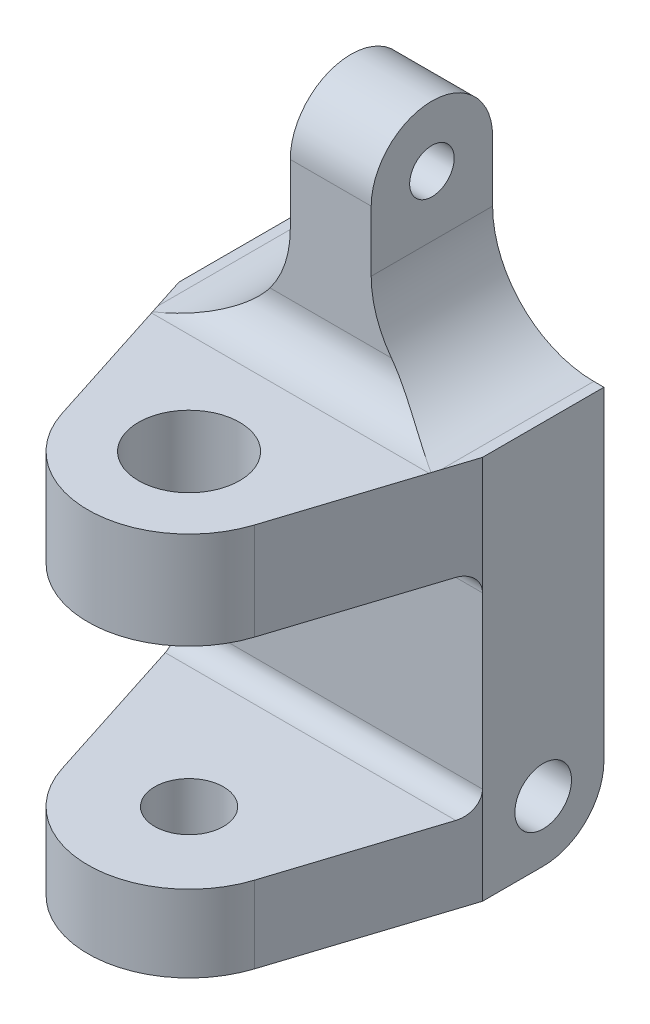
ISO-10303-21;
HEADER;
FILE_DESCRIPTION(('STEP AP214'),'2;1');
FILE_NAME('part.step','',(''),(''),'','','');
FILE_SCHEMA(('AUTOMOTIVE_DESIGN { 1 0 10303 214 1 1 1 1 }'));
ENDSEC;
DATA;
#1=APPLICATION_CONTEXT('core data for automotive mechanical design processes');
#2=APPLICATION_PROTOCOL_DEFINITION('international standard','automotive_design',2000,#1);
#3=PRODUCT_CONTEXT('',#1,'mechanical');
#4=PRODUCT('Part','Part','',(#3));
#5=PRODUCT_RELATED_PRODUCT_CATEGORY('part','',(#4));
#6=PRODUCT_DEFINITION_FORMATION('','',#4);
#7=PRODUCT_DEFINITION_CONTEXT('part definition',#1,'design');
#8=PRODUCT_DEFINITION('design','',#6,#7);
#9=PRODUCT_DEFINITION_SHAPE('','',#8);
#10=(LENGTH_UNIT() NAMED_UNIT(*) SI_UNIT(.MILLI.,.METRE.));
#11=(NAMED_UNIT(*) PLANE_ANGLE_UNIT() SI_UNIT($,.RADIAN.));
#12=(NAMED_UNIT(*) SI_UNIT($,.STERADIAN.) SOLID_ANGLE_UNIT());
#13=UNCERTAINTY_MEASURE_WITH_UNIT(LENGTH_MEASURE(1.E-05),#10,'distance_accuracy_value','');
#14=(GEOMETRIC_REPRESENTATION_CONTEXT(3) GLOBAL_UNCERTAINTY_ASSIGNED_CONTEXT((#13)) GLOBAL_UNIT_ASSIGNED_CONTEXT((#10,
#11,#12)) REPRESENTATION_CONTEXT('',''));
#15=CARTESIAN_POINT('',(0.,0.,0.));
#16=DIRECTION('',(0.,0.,1.));
#17=DIRECTION('',(1.,0.,0.));
#18=AXIS2_PLACEMENT_3D('',#15,#16,#17);
#19=CARTESIAN_POINT('',(0.,-19.05,12.7));
#20=DIRECTION('',(0.,1.,0.));
#21=DIRECTION('',(0.,0.,1.));
#22=AXIS2_PLACEMENT_3D('',#19,#20,#21);
#23=CYLINDRICAL_SURFACE('',#22,2.159);
#24=CARTESIAN_POINT('',(0.,-14.224,12.7));
#25=DIRECTION('',(0.,-1.,0.));
#26=DIRECTION('',(0.,0.,-1.));
#27=AXIS2_PLACEMENT_3D('',#24,#25,#26);
#28=CIRCLE('',#27,2.159);
#29=CARTESIAN_POINT('',(0.,-14.224,10.541));
#30=VERTEX_POINT('',#29);
#31=EDGE_CURVE('E335',#30,#30,#28,.T.);
#32=ORIENTED_EDGE('',*,*,#31,.F.);
#33=EDGE_LOOP('',(#32));
#34=FACE_BOUND('',#33,.T.);
#35=CARTESIAN_POINT('',(0.,-17.78,12.7));
#36=DIRECTION('',(0.,-1.,0.));
#37=DIRECTION('',(0.,0.,-1.));
#38=AXIS2_PLACEMENT_3D('',#35,#36,#37);
#39=CIRCLE('',#38,2.159);
#40=CARTESIAN_POINT('',(0.,-17.78,10.541));
#41=VERTEX_POINT('',#40);
#42=EDGE_CURVE('E36',#41,#41,#39,.F.);
#43=ORIENTED_EDGE('',*,*,#42,.F.);
#44=EDGE_LOOP('',(#43));
#45=FACE_BOUND('',#44,.T.);
#46=ADVANCED_FACE('F32',(#34,#45),#23,.F.);
#47=CARTESIAN_POINT('',(0.,-1.016,12.7));
#48=DIRECTION('',(0.,1.,0.));
#49=DIRECTION('',(0.,0.,1.));
#50=AXIS2_PLACEMENT_3D('',#47,#48,#49);
#51=CIRCLE('',#50,2.159);
#52=CARTESIAN_POINT('',(0.,-1.016,14.859));
#53=VERTEX_POINT('',#52);
#54=EDGE_CURVE('E336',#53,#53,#51,.T.);
#55=ORIENTED_EDGE('',*,*,#54,.F.);
#56=EDGE_LOOP('',(#55));
#57=FACE_BOUND('',#56,.T.);
#58=CARTESIAN_POINT('',(0.,0.,12.7));
#59=DIRECTION('',(0.,1.,0.));
#60=DIRECTION('',(0.,0.,1.));
#61=AXIS2_PLACEMENT_3D('',#58,#59,#60);
#62=CIRCLE('',#61,2.159);
#63=CARTESIAN_POINT('',(0.,0.,14.859));
#64=VERTEX_POINT('',#63);
#65=EDGE_CURVE('E277',#64,#64,#62,.F.);
#66=ORIENTED_EDGE('',*,*,#65,.F.);
#67=EDGE_LOOP('',(#66));
#68=FACE_BOUND('',#67,.T.);
#69=ADVANCED_FACE('F526',(#57,#68),#23,.F.);
#70=CARTESIAN_POINT('',(9.525,-19.05,3.81000000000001));
#71=DIRECTION('',(0.952091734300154,0.,0.305812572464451));
#72=DIRECTION('',(0.305812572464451,0.,-0.952091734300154));
#73=AXIS2_PLACEMENT_3D('',#70,#71,#72);
#74=PLANE('',#73);
#75=DIRECTION('',(0.305812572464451,0.,-0.952091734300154));
#76=VECTOR('',#75,1.);
#77=CARTESIAN_POINT('',(9.525,5.08,3.81));
#78=LINE('',#77,#76);
#79=CARTESIAN_POINT('',(8.89,5.08,5.78695682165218));
#80=VERTEX_POINT('',#79);
#81=CARTESIAN_POINT('',(9.525,5.08,3.81000000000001));
#82=VERTEX_POINT('',#81);
#83=EDGE_CURVE('E333',#80,#82,#78,.T.);
#84=ORIENTED_EDGE('',*,*,#83,.F.);
#85=CARTESIAN_POINT('',(8.89,11.43,5.78695682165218));
#86=DIRECTION('',(0.952091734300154,0.,0.305812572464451));
#87=DIRECTION('',(-0.305812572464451,0.,0.952091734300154));
#88=AXIS2_PLACEMENT_3D('',#85,#86,#87);
#89=ELLIPSE('',#88,20.7643523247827,6.35);
#90=CARTESIAN_POINT('',(8.73968306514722,5.08177939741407,6.25494121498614));
#91=VERTEX_POINT('',#90);
#92=EDGE_CURVE('E325',#91,#80,#89,.T.);
#93=ORIENTED_EDGE('',*,*,#92,.F.);
#94=CARTESIAN_POINT('',(8.70915011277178,7.62,6.35000000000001));
#95=DIRECTION('',(0.952091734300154,0.,0.305812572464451));
#96=DIRECTION('',(0.305812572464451,0.,-0.952091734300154));
#97=AXIS2_PLACEMENT_3D('',#94,#95,#96);
#98=ELLIPSE('',#97,2.66781015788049,2.54);
#99=CARTESIAN_POINT('',(8.70915011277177,5.08,6.35000000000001));
#100=VERTEX_POINT('',#99);
#101=EDGE_CURVE('E373',#100,#91,#98,.T.);
#102=ORIENTED_EDGE('',*,*,#101,.F.);
#103=DIRECTION('',(0.305812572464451,0.,-0.952091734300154));
#104=VECTOR('',#103,1.);
#105=CARTESIAN_POINT('',(9.525,5.08,3.81000000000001));
#106=LINE('',#105,#104);
#107=CARTESIAN_POINT('',(6.04578251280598,5.08,14.6419098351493));
#108=VERTEX_POINT('',#107);
#109=EDGE_CURVE('E371',#108,#100,#106,.T.);
#110=ORIENTED_EDGE('',*,*,#109,.F.);
#111=DIRECTION('',(0.,1.,0.));
#112=VECTOR('',#111,1.);
#113=CARTESIAN_POINT('',(6.04578251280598,-19.05,14.6419098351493));
#114=LINE('',#113,#112);
#115=CARTESIAN_POINT('',(6.04578251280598,-1.016,14.6419098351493));
#116=VERTEX_POINT('',#115);
#117=EDGE_CURVE('E409',#116,#108,#114,.T.);
#118=ORIENTED_EDGE('',*,*,#117,.F.);
#119=DIRECTION('',(-0.305812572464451,0.,0.952091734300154));
#120=VECTOR('',#119,1.);
#121=CARTESIAN_POINT('',(9.525,-1.016,3.81000000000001));
#122=LINE('',#121,#120);
#123=CARTESIAN_POINT('',(9.11707505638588,-1.016,5.08000000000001));
#124=VERTEX_POINT('',#123);
#125=EDGE_CURVE('E386',#124,#116,#122,.T.);
#126=ORIENTED_EDGE('',*,*,#125,.F.);
#127=CARTESIAN_POINT('',(9.11707505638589,-2.286,5.08000000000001));
#128=DIRECTION('',(0.952091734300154,0.,0.305812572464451));
#129=DIRECTION('',(0.305812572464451,0.,-0.952091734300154));
#130=AXIS2_PLACEMENT_3D('',#127,#128,#129);
#131=ELLIPSE('',#130,1.33390507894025,1.27);
#132=CARTESIAN_POINT('',(9.525,-2.286,3.81000000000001));
#133=VERTEX_POINT('',#132);
#134=EDGE_CURVE('E382',#133,#124,#131,.T.);
#135=ORIENTED_EDGE('',*,*,#134,.F.);
#136=DIRECTION('',(0.,-1.,0.));
#137=VECTOR('',#136,1.);
#138=CARTESIAN_POINT('',(9.525,15.24,3.81000000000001));
#139=LINE('',#138,#137);
#140=EDGE_CURVE('E413',#82,#133,#139,.T.);
#141=ORIENTED_EDGE('',*,*,#140,.F.);
#142=EDGE_LOOP('',(#84,#93,#102,#110,#118,#126,#135,#141));
#143=FACE_BOUND('',#142,.T.);
#144=ADVANCED_FACE('F499',(#143),#74,.T.);
#145=CARTESIAN_POINT('',(0.,-19.05,12.7));
#146=DIRECTION('',(0.,1.,0.));
#147=DIRECTION('',(0.,0.,1.));
#148=AXIS2_PLACEMENT_3D('',#145,#146,#147);
#149=CYLINDRICAL_SURFACE('',#148,6.35);
#150=CARTESIAN_POINT('',(0.,-1.016,12.7));
#151=DIRECTION('',(0.,1.,0.));
#152=DIRECTION('',(0.,0.,1.));
#153=AXIS2_PLACEMENT_3D('',#150,#151,#152);
#154=CIRCLE('',#153,6.35);
#155=CARTESIAN_POINT('',(-6.04578251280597,-1.016,14.6419098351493));
#156=VERTEX_POINT('',#155);
#157=EDGE_CURVE('E384',#116,#156,#154,.F.);
#158=ORIENTED_EDGE('',*,*,#157,.F.);
#159=ORIENTED_EDGE('',*,*,#117,.T.);
#160=CARTESIAN_POINT('',(0.,5.08,12.7));
#161=DIRECTION('',(0.,-1.,0.));
#162=DIRECTION('',(0.,0.,-1.));
#163=AXIS2_PLACEMENT_3D('',#160,#161,#162);
#164=CIRCLE('',#163,6.35);
#165=CARTESIAN_POINT('',(-6.04578251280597,5.08,14.6419098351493));
#166=VERTEX_POINT('',#165);
#167=EDGE_CURVE('E357',#166,#108,#164,.F.);
#168=ORIENTED_EDGE('',*,*,#167,.F.);
#169=DIRECTION('',(0.,1.,0.));
#170=VECTOR('',#169,1.);
#171=CARTESIAN_POINT('',(-6.04578251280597,-19.05,14.6419098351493));
#172=LINE('',#171,#170);
#173=EDGE_CURVE('E404',#156,#166,#172,.T.);
#174=ORIENTED_EDGE('',*,*,#173,.F.);
#175=EDGE_LOOP('',(#158,#159,#168,#174));
#176=FACE_BOUND('',#175,.T.);
#177=ADVANCED_FACE('F503',(#176),#149,.T.);
#178=CARTESIAN_POINT('',(-9.525,-19.05,3.81000000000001));
#179=DIRECTION('',(-0.952091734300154,0.,0.305812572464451));
#180=DIRECTION('',(0.305812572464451,0.,0.952091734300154));
#181=AXIS2_PLACEMENT_3D('',#178,#179,#180);
#182=PLANE('',#181);
#183=CARTESIAN_POINT('',(-8.89,11.43,5.78695682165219));
#184=DIRECTION('',(-0.952091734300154,0.,0.305812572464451));
#185=DIRECTION('',(0.305812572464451,0.,0.952091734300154));
#186=AXIS2_PLACEMENT_3D('',#183,#184,#185);
#187=ELLIPSE('',#186,20.7643523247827,6.35);
#188=CARTESIAN_POINT('',(-8.89,5.08,5.78695682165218));
#189=VERTEX_POINT('',#188);
#190=CARTESIAN_POINT('',(-8.73968306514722,5.08177939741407,6.25494121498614));
#191=VERTEX_POINT('',#190);
#192=EDGE_CURVE('E57',#189,#191,#187,.T.);
#193=ORIENTED_EDGE('',*,*,#192,.F.);
#194=DIRECTION('',(0.305812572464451,0.,0.952091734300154));
#195=VECTOR('',#194,1.);
#196=CARTESIAN_POINT('',(-9.525,5.08,3.81));
#197=LINE('',#196,#195);
#198=CARTESIAN_POINT('',(-9.525,5.08,3.81000000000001));
#199=VERTEX_POINT('',#198);
#200=EDGE_CURVE('E331',#199,#189,#197,.T.);
#201=ORIENTED_EDGE('',*,*,#200,.F.);
#202=DIRECTION('',(0.,-1.,0.));
#203=VECTOR('',#202,1.);
#204=CARTESIAN_POINT('',(-9.525,15.24,3.81000000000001));
#205=LINE('',#204,#203);
#206=CARTESIAN_POINT('',(-9.525,-2.286,3.81));
#207=VERTEX_POINT('',#206);
#208=EDGE_CURVE('E422',#199,#207,#205,.T.);
#209=ORIENTED_EDGE('',*,*,#208,.T.);
#210=CARTESIAN_POINT('',(-9.11707505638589,-2.286,5.08000000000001));
#211=DIRECTION('',(-0.952091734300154,0.,0.305812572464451));
#212=DIRECTION('',(0.305812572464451,0.,0.952091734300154));
#213=AXIS2_PLACEMENT_3D('',#210,#211,#212);
#214=ELLIPSE('',#213,1.33390507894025,1.27);
#215=CARTESIAN_POINT('',(-9.11707505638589,-1.016,5.08000000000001));
#216=VERTEX_POINT('',#215);
#217=EDGE_CURVE('E445',#216,#207,#214,.T.);
#218=ORIENTED_EDGE('',*,*,#217,.F.);
#219=DIRECTION('',(-0.305812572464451,0.,-0.952091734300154));
#220=VECTOR('',#219,1.);
#221=CARTESIAN_POINT('',(-9.525,-1.016,3.81000000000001));
#222=LINE('',#221,#220);
#223=EDGE_CURVE('E448',#156,#216,#222,.T.);
#224=ORIENTED_EDGE('',*,*,#223,.F.);
#225=ORIENTED_EDGE('',*,*,#173,.T.);
#226=DIRECTION('',(0.305812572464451,0.,0.952091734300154));
#227=VECTOR('',#226,1.);
#228=CARTESIAN_POINT('',(-9.525,5.08,3.81000000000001));
#229=LINE('',#228,#227);
#230=CARTESIAN_POINT('',(-8.70915011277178,5.08,6.35000000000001));
#231=VERTEX_POINT('',#230);
#232=EDGE_CURVE('E437',#231,#166,#229,.T.);
#233=ORIENTED_EDGE('',*,*,#232,.F.);
#234=CARTESIAN_POINT('',(-8.70915011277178,7.62,6.35000000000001));
#235=DIRECTION('',(-0.952091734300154,0.,0.305812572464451));
#236=DIRECTION('',(0.305812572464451,0.,0.952091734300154));
#237=AXIS2_PLACEMENT_3D('',#234,#235,#236);
#238=ELLIPSE('',#237,2.66781015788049,2.54);
#239=EDGE_CURVE('E439',#191,#231,#238,.T.);
#240=ORIENTED_EDGE('',*,*,#239,.F.);
#241=EDGE_LOOP('',(#193,#201,#209,#218,#224,#225,#233,#240));
#242=FACE_BOUND('',#241,.T.);
#243=ADVANCED_FACE('F507',(#242),#182,.T.);
#244=CARTESIAN_POINT('',(9.525,15.24,0.));
#245=DIRECTION('',(-1.,0.,0.));
#246=DIRECTION('',(0.,0.,1.));
#247=AXIS2_PLACEMENT_3D('',#244,#245,#246);
#248=CYLINDRICAL_SURFACE('',#247,3.81);
#249=CARTESIAN_POINT('',(-2.54,15.24,0.));
#250=DIRECTION('',(1.,0.,0.));
#251=DIRECTION('',(0.,1.,0.));
#252=AXIS2_PLACEMENT_3D('',#249,#250,#251);
#253=CIRCLE('',#252,3.81);
#254=CARTESIAN_POINT('',(-2.54,15.24,-3.81));
#255=VERTEX_POINT('',#254);
#256=CARTESIAN_POINT('',(-2.54,15.24,3.81000000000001));
#257=VERTEX_POINT('',#256);
#258=EDGE_CURVE('E320',#255,#257,#253,.T.);
#259=ORIENTED_EDGE('',*,*,#258,.T.);
#260=DIRECTION('',(-1.,0.,0.));
#261=VECTOR('',#260,1.);
#262=CARTESIAN_POINT('',(9.525,15.24,3.81000000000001));
#263=LINE('',#262,#261);
#264=CARTESIAN_POINT('',(2.54000000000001,15.24,3.81000000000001));
#265=VERTEX_POINT('',#264);
#266=EDGE_CURVE('E434',#265,#257,#263,.T.);
#267=ORIENTED_EDGE('',*,*,#266,.F.);
#268=CARTESIAN_POINT('',(2.54000000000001,15.24,0.));
#269=DIRECTION('',(-1.,0.,0.));
#270=DIRECTION('',(0.,-1.,0.));
#271=AXIS2_PLACEMENT_3D('',#268,#269,#270);
#272=CIRCLE('',#271,3.81);
#273=CARTESIAN_POINT('',(2.54000000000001,15.24,-3.81));
#274=VERTEX_POINT('',#273);
#275=EDGE_CURVE('E314',#265,#274,#272,.T.);
#276=ORIENTED_EDGE('',*,*,#275,.T.);
#277=DIRECTION('',(-1.,0.,0.));
#278=VECTOR('',#277,1.);
#279=CARTESIAN_POINT('',(9.525,15.24,-3.80999999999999));
#280=LINE('',#279,#278);
#281=EDGE_CURVE('E421',#274,#255,#280,.T.);
#282=ORIENTED_EDGE('',*,*,#281,.T.);
#283=EDGE_LOOP('',(#259,#267,#276,#282));
#284=FACE_BOUND('',#283,.T.);
#285=ADVANCED_FACE('F34',(#284),#248,.T.);
#286=CARTESIAN_POINT('',(9.525,-15.24,0.));
#287=DIRECTION('',(-1.,0.,0.));
#288=DIRECTION('',(0.,0.,1.));
#289=AXIS2_PLACEMENT_3D('',#286,#287,#288);
#290=CYLINDRICAL_SURFACE('',#289,3.81);
#291=CARTESIAN_POINT('',(9.525,-15.24,0.));
#292=DIRECTION('',(1.,0.,0.));
#293=DIRECTION('',(0.,0.,-1.));
#294=AXIS2_PLACEMENT_3D('',#291,#292,#293);
#295=CIRCLE('',#294,3.81);
#296=CARTESIAN_POINT('',(9.525,-19.05,0.));
#297=VERTEX_POINT('',#296);
#298=CARTESIAN_POINT('',(9.525,-15.24,-3.81));
#299=VERTEX_POINT('',#298);
#300=EDGE_CURVE('E415',#297,#299,#295,.T.);
#301=ORIENTED_EDGE('',*,*,#300,.F.);
#302=DIRECTION('',(-1.,0.,0.));
#303=VECTOR('',#302,1.);
#304=CARTESIAN_POINT('',(-9.525,-19.05,0.));
#305=LINE('',#304,#303);
#306=CARTESIAN_POINT('',(-9.525,-19.05,0.));
#307=VERTEX_POINT('',#306);
#308=EDGE_CURVE('E391',#297,#307,#305,.T.);
#309=ORIENTED_EDGE('',*,*,#308,.T.);
#310=CARTESIAN_POINT('',(-9.525,-15.24,0.));
#311=DIRECTION('',(1.,0.,0.));
#312=DIRECTION('',(0.,0.,-1.));
#313=AXIS2_PLACEMENT_3D('',#310,#311,#312);
#314=CIRCLE('',#313,3.81);
#315=CARTESIAN_POINT('',(-9.525,-15.24,-3.81));
#316=VERTEX_POINT('',#315);
#317=EDGE_CURVE('E424',#307,#316,#314,.T.);
#318=ORIENTED_EDGE('',*,*,#317,.T.);
#319=DIRECTION('',(-1.,0.,0.));
#320=VECTOR('',#319,1.);
#321=CARTESIAN_POINT('',(9.525,-15.24,-3.81));
#322=LINE('',#321,#320);
#323=EDGE_CURVE('E431',#299,#316,#322,.T.);
#324=ORIENTED_EDGE('',*,*,#323,.F.);
#325=EDGE_LOOP('',(#301,#309,#318,#324));
#326=FACE_BOUND('',#325,.T.);
#327=ADVANCED_FACE('F517',(#326),#290,.T.);
#328=CARTESIAN_POINT('',(9.525,15.24,-3.80999999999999));
#329=DIRECTION('',(0.,0.,1.));
#330=DIRECTION('',(0.,-1.,0.));
#331=AXIS2_PLACEMENT_3D('',#328,#329,#330);
#332=PLANE('',#331);
#333=CARTESIAN_POINT('',(-8.89,11.43,-3.81));
#334=DIRECTION('',(0.,0.,1.));
#335=DIRECTION('',(-1.,0.,0.));
#336=AXIS2_PLACEMENT_3D('',#333,#334,#335);
#337=CIRCLE('',#336,6.35);
#338=CARTESIAN_POINT('',(-8.89,5.08,-3.81));
#339=VERTEX_POINT('',#338);
#340=CARTESIAN_POINT('',(-2.54,11.43,-3.81));
#341=VERTEX_POINT('',#340);
#342=EDGE_CURVE('E284',#339,#341,#337,.T.);
#343=ORIENTED_EDGE('',*,*,#342,.T.);
#344=DIRECTION('',(0.,1.,0.));
#345=VECTOR('',#344,1.);
#346=CARTESIAN_POINT('',(-2.54,19.05,-3.81));
#347=LINE('',#346,#345);
#348=EDGE_CURVE('E288',#341,#255,#347,.T.);
#349=ORIENTED_EDGE('',*,*,#348,.T.);
#350=ORIENTED_EDGE('',*,*,#281,.F.);
#351=DIRECTION('',(0.,-1.,0.));
#352=VECTOR('',#351,1.);
#353=CARTESIAN_POINT('',(2.54000000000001,19.05,-3.81));
#354=LINE('',#353,#352);
#355=CARTESIAN_POINT('',(2.54000000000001,11.43,-3.81));
#356=VERTEX_POINT('',#355);
#357=EDGE_CURVE('E297',#274,#356,#354,.T.);
#358=ORIENTED_EDGE('',*,*,#357,.T.);
#359=CARTESIAN_POINT('',(8.89,11.43,-3.81));
#360=DIRECTION('',(0.,0.,1.));
#361=DIRECTION('',(1.,0.,0.));
#362=AXIS2_PLACEMENT_3D('',#359,#360,#361);
#363=CIRCLE('',#362,6.35);
#364=CARTESIAN_POINT('',(8.89,5.08,-3.81));
#365=VERTEX_POINT('',#364);
#366=EDGE_CURVE('E300',#356,#365,#363,.T.);
#367=ORIENTED_EDGE('',*,*,#366,.T.);
#368=DIRECTION('',(1.,0.,0.));
#369=VECTOR('',#368,1.);
#370=CARTESIAN_POINT('',(8.89,5.08,-3.81));
#371=LINE('',#370,#369);
#372=CARTESIAN_POINT('',(9.525,5.08,-3.81));
#373=VERTEX_POINT('',#372);
#374=EDGE_CURVE('E303',#365,#373,#371,.T.);
#375=ORIENTED_EDGE('',*,*,#374,.T.);
#376=DIRECTION('',(0.,1.,0.));
#377=VECTOR('',#376,1.);
#378=CARTESIAN_POINT('',(9.525,15.24,-3.80999999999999));
#379=LINE('',#378,#377);
#380=EDGE_CURVE('E418',#299,#373,#379,.T.);
#381=ORIENTED_EDGE('',*,*,#380,.F.);
#382=ORIENTED_EDGE('',*,*,#323,.T.);
#383=DIRECTION('',(0.,1.,0.));
#384=VECTOR('',#383,1.);
#385=CARTESIAN_POINT('',(-9.525,15.24,-3.80999999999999));
#386=LINE('',#385,#384);
#387=CARTESIAN_POINT('',(-9.525,5.08,-3.81));
#388=VERTEX_POINT('',#387);
#389=EDGE_CURVE('E426',#316,#388,#386,.T.);
#390=ORIENTED_EDGE('',*,*,#389,.T.);
#391=DIRECTION('',(1.,0.,0.));
#392=VECTOR('',#391,1.);
#393=CARTESIAN_POINT('',(-8.89,5.08,-3.81));
#394=LINE('',#393,#392);
#395=EDGE_CURVE('E281',#388,#339,#394,.T.);
#396=ORIENTED_EDGE('',*,*,#395,.T.);
#397=EDGE_LOOP('',(#343,#349,#350,#358,#367,#375,#381,#382,#390,#396));
#398=FACE_BOUND('',#397,.T.);
#399=ADVANCED_FACE('F511',(#398),#332,.F.);
#400=CARTESIAN_POINT('',(9.525,15.24,0.));
#401=DIRECTION('',(1.,0.,0.));
#402=DIRECTION('',(0.,0.,-1.));
#403=AXIS2_PLACEMENT_3D('',#400,#401,#402);
#404=PLANE('',#403);
#405=DIRECTION('',(0.,0.,-1.));
#406=VECTOR('',#405,1.);
#407=CARTESIAN_POINT('',(9.525,5.08,0.));
#408=LINE('',#407,#406);
#409=EDGE_CURVE('E11',#82,#373,#408,.T.);
#410=ORIENTED_EDGE('',*,*,#409,.F.);
#411=ORIENTED_EDGE('',*,*,#140,.T.);
#412=DIRECTION('',(0.,1.,0.));
#413=VECTOR('',#412,1.);
#414=CARTESIAN_POINT('',(9.525,-12.954,3.81000000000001));
#415=LINE('',#414,#413);
#416=CARTESIAN_POINT('',(9.525,-12.954,3.81000000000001));
#417=VERTEX_POINT('',#416);
#418=EDGE_CURVE('E346',#417,#133,#415,.T.);
#419=ORIENTED_EDGE('',*,*,#418,.F.);
#420=CARTESIAN_POINT('',(9.525,-19.05,3.81000000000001));
#421=VERTEX_POINT('',#420);
#422=EDGE_CURVE('E416',#417,#421,#139,.T.);
#423=ORIENTED_EDGE('',*,*,#422,.T.);
#424=DIRECTION('',(0.,0.,-1.));
#425=VECTOR('',#424,1.);
#426=CARTESIAN_POINT('',(9.525,-19.05,0.));
#427=LINE('',#426,#425);
#428=EDGE_CURVE('E388',#421,#297,#427,.T.);
#429=ORIENTED_EDGE('',*,*,#428,.T.);
#430=ORIENTED_EDGE('',*,*,#300,.T.);
#431=ORIENTED_EDGE('',*,*,#380,.T.);
#432=EDGE_LOOP('',(#410,#411,#419,#423,#429,#430,#431));
#433=FACE_BOUND('',#432,.T.);
#434=CARTESIAN_POINT('',(9.525,-15.24,0.));
#435=DIRECTION('',(-1.,0.,0.));
#436=DIRECTION('',(0.,0.,1.));
#437=AXIS2_PLACEMENT_3D('',#434,#435,#436);
#438=CIRCLE('',#437,1.778);
#439=CARTESIAN_POINT('',(9.525,-15.24,1.778));
#440=VERTEX_POINT('',#439);
#441=EDGE_CURVE('E340',#440,#440,#438,.T.);
#442=ORIENTED_EDGE('',*,*,#441,.T.);
#443=EDGE_LOOP('',(#442));
#444=FACE_BOUND('',#443,.T.);
#445=ADVANCED_FACE('F508',(#433,#444),#404,.T.);
#446=CARTESIAN_POINT('',(-9.525,15.24,0.));
#447=DIRECTION('',(1.,0.,0.));
#448=DIRECTION('',(0.,0.,-1.));
#449=AXIS2_PLACEMENT_3D('',#446,#447,#448);
#450=PLANE('',#449);
#451=CARTESIAN_POINT('',(-9.525,-15.24,0.));
#452=DIRECTION('',(-1.,0.,0.));
#453=DIRECTION('',(0.,0.,1.));
#454=AXIS2_PLACEMENT_3D('',#451,#452,#453);
#455=CIRCLE('',#454,1.778);
#456=CARTESIAN_POINT('',(-9.525,-15.24,1.778));
#457=VERTEX_POINT('',#456);
#458=EDGE_CURVE('E339',#457,#457,#455,.T.);
#459=ORIENTED_EDGE('',*,*,#458,.F.);
#460=EDGE_LOOP('',(#459));
#461=FACE_BOUND('',#460,.T.);
#462=ORIENTED_EDGE('',*,*,#208,.F.);
#463=DIRECTION('',(0.,0.,-1.));
#464=VECTOR('',#463,1.);
#465=CARTESIAN_POINT('',(-9.525,5.08,0.));
#466=LINE('',#465,#464);
#467=EDGE_CURVE('E41',#199,#388,#466,.T.);
#468=ORIENTED_EDGE('',*,*,#467,.T.);
#469=ORIENTED_EDGE('',*,*,#389,.F.);
#470=ORIENTED_EDGE('',*,*,#317,.F.);
#471=DIRECTION('',(0.,0.,1.));
#472=VECTOR('',#471,1.);
#473=CARTESIAN_POINT('',(-9.525,-19.05,3.81000000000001));
#474=LINE('',#473,#472);
#475=CARTESIAN_POINT('',(-9.525,-19.05,3.81000000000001));
#476=VERTEX_POINT('',#475);
#477=EDGE_CURVE('E393',#307,#476,#474,.T.);
#478=ORIENTED_EDGE('',*,*,#477,.T.);
#479=CARTESIAN_POINT('',(-9.525,-12.954,3.81000000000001));
#480=VERTEX_POINT('',#479);
#481=EDGE_CURVE('E408',#480,#476,#205,.T.);
#482=ORIENTED_EDGE('',*,*,#481,.F.);
#483=DIRECTION('',(0.,1.,0.));
#484=VECTOR('',#483,1.);
#485=CARTESIAN_POINT('',(-9.525,-12.954,3.81000000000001));
#486=LINE('',#485,#484);
#487=EDGE_CURVE('E349',#480,#207,#486,.T.);
#488=ORIENTED_EDGE('',*,*,#487,.T.);
#489=EDGE_LOOP('',(#462,#468,#469,#470,#478,#482,#488));
#490=FACE_BOUND('',#489,.T.);
#491=ADVANCED_FACE('F497',(#461,#490),#450,.F.);
#492=CARTESIAN_POINT('',(9.11707505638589,-12.954,5.08000000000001));
#493=DIRECTION('',(0.952091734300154,0.,0.305812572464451));
#494=DIRECTION('',(0.305812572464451,0.,-0.952091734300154));
#495=AXIS2_PLACEMENT_3D('',#492,#493,#494);
#496=ELLIPSE('',#495,1.33390507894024,1.27);
#497=CARTESIAN_POINT('',(9.11707505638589,-14.224,5.08000000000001));
#498=VERTEX_POINT('',#497);
#499=EDGE_CURVE('E380',#498,#417,#496,.T.);
#500=ORIENTED_EDGE('',*,*,#499,.F.);
#501=DIRECTION('',(0.305812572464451,0.,-0.952091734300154));
#502=VECTOR('',#501,1.);
#503=CARTESIAN_POINT('',(9.525,-14.224,3.81000000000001));
#504=LINE('',#503,#502);
#505=CARTESIAN_POINT('',(6.04578251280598,-14.224,14.6419098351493));
#506=VERTEX_POINT('',#505);
#507=EDGE_CURVE('E378',#506,#498,#504,.T.);
#508=ORIENTED_EDGE('',*,*,#507,.F.);
#509=CARTESIAN_POINT('',(6.04578251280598,-19.05,14.6419098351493));
#510=VERTEX_POINT('',#509);
#511=EDGE_CURVE('E405',#510,#506,#114,.T.);
#512=ORIENTED_EDGE('',*,*,#511,.F.);
#513=DIRECTION('',(0.305812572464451,0.,-0.952091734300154));
#514=VECTOR('',#513,1.);
#515=CARTESIAN_POINT('',(9.525,-19.05,3.81000000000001));
#516=LINE('',#515,#514);
#517=EDGE_CURVE('E401',#510,#421,#516,.T.);
#518=ORIENTED_EDGE('',*,*,#517,.T.);
#519=ORIENTED_EDGE('',*,*,#422,.F.);
#520=EDGE_LOOP('',(#500,#508,#512,#518,#519));
#521=FACE_BOUND('',#520,.T.);
#522=ADVANCED_FACE('F493',(#521),#74,.T.);
#523=CARTESIAN_POINT('',(0.,-14.224,12.7));
#524=DIRECTION('',(0.,-1.,0.));
#525=DIRECTION('',(0.,0.,-1.));
#526=AXIS2_PLACEMENT_3D('',#523,#524,#525);
#527=CIRCLE('',#526,6.35);
#528=CARTESIAN_POINT('',(-6.04578251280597,-14.224,14.6419098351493));
#529=VERTEX_POINT('',#528);
#530=EDGE_CURVE('E376',#529,#506,#527,.F.);
#531=ORIENTED_EDGE('',*,*,#530,.F.);
#532=CARTESIAN_POINT('',(-6.04578251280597,-19.05,14.6419098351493));
#533=VERTEX_POINT('',#532);
#534=EDGE_CURVE('E410',#533,#529,#172,.T.);
#535=ORIENTED_EDGE('',*,*,#534,.F.);
#536=CARTESIAN_POINT('',(0.,-19.05,12.7));
#537=DIRECTION('',(0.,1.,0.));
#538=DIRECTION('',(0.,0.,1.));
#539=AXIS2_PLACEMENT_3D('',#536,#537,#538);
#540=CIRCLE('',#539,6.35);
#541=EDGE_CURVE('E399',#533,#510,#540,.T.);
#542=ORIENTED_EDGE('',*,*,#541,.T.);
#543=ORIENTED_EDGE('',*,*,#511,.T.);
#544=EDGE_LOOP('',(#531,#535,#542,#543));
#545=FACE_BOUND('',#544,.T.);
#546=ADVANCED_FACE('F496',(#545),#149,.T.);
#547=CARTESIAN_POINT('',(-9.11707505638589,-12.954,5.08000000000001));
#548=DIRECTION('',(-0.952091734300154,0.,0.305812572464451));
#549=DIRECTION('',(0.305812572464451,0.,0.952091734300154));
#550=AXIS2_PLACEMENT_3D('',#547,#548,#549);
#551=ELLIPSE('',#550,1.33390507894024,1.27);
#552=CARTESIAN_POINT('',(-9.11707505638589,-14.224,5.08000000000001));
#553=VERTEX_POINT('',#552);
#554=EDGE_CURVE('E443',#480,#553,#551,.T.);
#555=ORIENTED_EDGE('',*,*,#554,.F.);
#556=ORIENTED_EDGE('',*,*,#481,.T.);
#557=DIRECTION('',(0.305812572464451,0.,0.952091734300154));
#558=VECTOR('',#557,1.);
#559=CARTESIAN_POINT('',(-9.525,-19.05,3.81000000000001));
#560=LINE('',#559,#558);
#561=EDGE_CURVE('E396',#476,#533,#560,.T.);
#562=ORIENTED_EDGE('',*,*,#561,.T.);
#563=ORIENTED_EDGE('',*,*,#534,.T.);
#564=DIRECTION('',(0.305812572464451,0.,0.952091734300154));
#565=VECTOR('',#564,1.);
#566=CARTESIAN_POINT('',(-9.525,-14.224,3.81000000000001));
#567=LINE('',#566,#565);
#568=EDGE_CURVE('E441',#553,#529,#567,.T.);
#569=ORIENTED_EDGE('',*,*,#568,.F.);
#570=EDGE_LOOP('',(#555,#556,#562,#563,#569));
#571=FACE_BOUND('',#570,.T.);
#572=ADVANCED_FACE('F491',(#571),#182,.T.);
#573=CARTESIAN_POINT('',(0.,-19.05,12.7));
#574=DIRECTION('',(0.,-1.,0.));
#575=DIRECTION('',(0.,0.,-1.));
#576=AXIS2_PLACEMENT_3D('',#573,#574,#575);
#577=PLANE('',#576);
#578=DIRECTION('',(0.866025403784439,0.,-0.5));
#579=VECTOR('',#578,1.);
#580=CARTESIAN_POINT('',(-4.445,-19.05,10.1336780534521));
#581=LINE('',#580,#579);
#582=CARTESIAN_POINT('',(-4.445,-19.05,10.1336780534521));
#583=VERTEX_POINT('',#582);
#584=CARTESIAN_POINT('',(0.,-19.05,7.56735610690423));
#585=VERTEX_POINT('',#584);
#586=EDGE_CURVE('E49',#583,#585,#581,.T.);
#587=ORIENTED_EDGE('',*,*,#586,.F.);
#588=DIRECTION('',(0.,0.,-1.));
#589=VECTOR('',#588,1.);
#590=CARTESIAN_POINT('',(-4.445,-19.05,15.2663219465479));
#591=LINE('',#590,#589);
#592=CARTESIAN_POINT('',(-4.445,-19.05,15.2663219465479));
#593=VERTEX_POINT('',#592);
#594=EDGE_CURVE('E241',#593,#583,#591,.T.);
#595=ORIENTED_EDGE('',*,*,#594,.F.);
#596=DIRECTION('',(-0.866025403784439,0.,-0.5));
#597=VECTOR('',#596,1.);
#598=CARTESIAN_POINT('',(0.,-19.05,17.8326438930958));
#599=LINE('',#598,#597);
#600=CARTESIAN_POINT('',(0.,-19.05,17.8326438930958));
#601=VERTEX_POINT('',#600);
#602=EDGE_CURVE('E244',#601,#593,#599,.T.);
#603=ORIENTED_EDGE('',*,*,#602,.F.);
#604=DIRECTION('',(-0.866025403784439,0.,0.5));
#605=VECTOR('',#604,1.);
#606=CARTESIAN_POINT('',(4.445,-19.05,15.2663219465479));
#607=LINE('',#606,#605);
#608=CARTESIAN_POINT('',(4.445,-19.05,15.2663219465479));
#609=VERTEX_POINT('',#608);
#610=EDGE_CURVE('E260',#609,#601,#607,.T.);
#611=ORIENTED_EDGE('',*,*,#610,.F.);
#612=DIRECTION('',(0.,0.,1.));
#613=VECTOR('',#612,1.);
#614=CARTESIAN_POINT('',(4.445,-19.05,10.1336780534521));
#615=LINE('',#614,#613);
#616=CARTESIAN_POINT('',(4.445,-19.05,10.1336780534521));
#617=VERTEX_POINT('',#616);
#618=EDGE_CURVE('E257',#617,#609,#615,.T.);
#619=ORIENTED_EDGE('',*,*,#618,.F.);
#620=DIRECTION('',(0.866025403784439,0.,0.5));
#621=VECTOR('',#620,1.);
#622=CARTESIAN_POINT('',(0.,-19.05,7.56735610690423));
#623=LINE('',#622,#621);
#624=EDGE_CURVE('E255',#585,#617,#623,.T.);
#625=ORIENTED_EDGE('',*,*,#624,.F.);
#626=EDGE_LOOP('',(#587,#595,#603,#611,#619,#625));
#627=FACE_BOUND('',#626,.T.);
#628=ORIENTED_EDGE('',*,*,#428,.F.);
#629=ORIENTED_EDGE('',*,*,#517,.F.);
#630=ORIENTED_EDGE('',*,*,#541,.F.);
#631=ORIENTED_EDGE('',*,*,#561,.F.);
#632=ORIENTED_EDGE('',*,*,#477,.F.);
#633=ORIENTED_EDGE('',*,*,#308,.F.);
#634=EDGE_LOOP('',(#628,#629,#630,#631,#632,#633));
#635=FACE_BOUND('',#634,.T.);
#636=ADVANCED_FACE('F488',(#627,#635),#577,.T.);
#637=CARTESIAN_POINT('',(-9.525,7.62,3.81000000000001));
#638=DIRECTION('',(0.,0.,-1.));
#639=DIRECTION('',(0.,1.,0.));
#640=AXIS2_PLACEMENT_3D('',#637,#638,#639);
#641=PLANE('',#640);
#642=ORIENTED_EDGE('',*,*,#266,.T.);
#643=DIRECTION('',(0.,-1.,0.));
#644=VECTOR('',#643,1.);
#645=CARTESIAN_POINT('',(-2.54,7.62,3.81000000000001));
#646=LINE('',#645,#644);
#647=CARTESIAN_POINT('',(-2.54,11.43,3.81000000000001));
#648=VERTEX_POINT('',#647);
#649=EDGE_CURVE('E317',#257,#648,#646,.T.);
#650=ORIENTED_EDGE('',*,*,#649,.T.);
#651=CARTESIAN_POINT('',(-8.89,11.43,3.81000000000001));
#652=DIRECTION('',(0.,0.,-1.));
#653=DIRECTION('',(0.,1.,0.));
#654=AXIS2_PLACEMENT_3D('',#651,#652,#653);
#655=CIRCLE('',#654,6.35);
#656=CARTESIAN_POINT('',(-3.81,7.62,3.81000000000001));
#657=VERTEX_POINT('',#656);
#658=EDGE_CURVE('E327',#648,#657,#655,.T.);
#659=ORIENTED_EDGE('',*,*,#658,.T.);
#660=DIRECTION('',(1.,0.,0.));
#661=VECTOR('',#660,1.);
#662=CARTESIAN_POINT('',(-9.525,7.62,3.81000000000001));
#663=LINE('',#662,#661);
#664=CARTESIAN_POINT('',(3.80999999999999,7.62,3.81000000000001));
#665=VERTEX_POINT('',#664);
#666=EDGE_CURVE('E350',#657,#665,#663,.T.);
#667=ORIENTED_EDGE('',*,*,#666,.T.);
#668=CARTESIAN_POINT('',(8.89,11.43,3.81000000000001));
#669=DIRECTION('',(0.,0.,-1.));
#670=DIRECTION('',(0.,1.,0.));
#671=AXIS2_PLACEMENT_3D('',#668,#669,#670);
#672=CIRCLE('',#671,6.35);
#673=CARTESIAN_POINT('',(2.54000000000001,11.43,3.81000000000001));
#674=VERTEX_POINT('',#673);
#675=EDGE_CURVE('E322',#665,#674,#672,.T.);
#676=ORIENTED_EDGE('',*,*,#675,.T.);
#677=DIRECTION('',(0.,1.,0.));
#678=VECTOR('',#677,1.);
#679=CARTESIAN_POINT('',(2.54000000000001,7.62,3.81000000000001));
#680=LINE('',#679,#678);
#681=EDGE_CURVE('E311',#674,#265,#680,.T.);
#682=ORIENTED_EDGE('',*,*,#681,.T.);
#683=EDGE_LOOP('',(#642,#650,#659,#667,#676,#682));
#684=FACE_BOUND('',#683,.T.);
#685=ADVANCED_FACE('F480',(#684),#641,.F.);
#686=CARTESIAN_POINT('',(-9.525,7.62,6.35000000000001));
#687=DIRECTION('',(1.,0.,0.));
#688=DIRECTION('',(0.,0.,-1.));
#689=AXIS2_PLACEMENT_3D('',#686,#687,#688);
#690=CYLINDRICAL_SURFACE('',#689,2.54);
#691=ORIENTED_EDGE('',*,*,#666,.F.);
#692=CARTESIAN_POINT('',(-3.81,7.62,3.81000000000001));
#693=CARTESIAN_POINT('',(-3.87514073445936,7.5331140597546,3.81000858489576));
#694=CARTESIAN_POINT('',(-3.94248912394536,7.44798901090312,3.81445569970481));
#695=CARTESIAN_POINT('',(-4.08092560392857,7.28187912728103,3.83122283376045));
#696=CARTESIAN_POINT('',(-4.15200703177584,7.20088739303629,3.84352923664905));
#697=CARTESIAN_POINT('',(-4.29677162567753,7.04410773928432,3.87486802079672));
#698=CARTESIAN_POINT('',(-4.37042363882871,6.96827767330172,3.89383535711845));
#699=CARTESIAN_POINT('',(-4.52053104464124,6.82117254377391,3.93766329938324));
#700=CARTESIAN_POINT('',(-4.59698805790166,6.74990018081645,3.96252735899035));
#701=CARTESIAN_POINT('',(-4.78522200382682,6.58282012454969,4.02900402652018));
#702=CARTESIAN_POINT('',(-4.89822439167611,6.4894286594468,4.0732473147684));
#703=CARTESIAN_POINT('',(-5.12802471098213,6.31227391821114,4.17017264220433));
#704=CARTESIAN_POINT('',(-5.24482358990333,6.22851306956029,4.22285680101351));
#705=CARTESIAN_POINT('',(-5.60111378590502,5.99055602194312,4.3918013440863));
#706=CARTESIAN_POINT('',(-5.84536436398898,5.85067639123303,4.51852547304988));
#707=CARTESIAN_POINT('',(-6.26872367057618,5.64297411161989,4.75013203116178));
#708=CARTESIAN_POINT('',(-6.4460069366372,5.56604015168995,4.85057303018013));
#709=CARTESIAN_POINT('',(-6.80349040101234,5.42953632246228,5.05814251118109));
#710=CARTESIAN_POINT('',(-6.98369199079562,5.36997501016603,5.16527425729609));
#711=CARTESIAN_POINT('',(-7.34563351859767,5.26779746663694,5.38393475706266));
#712=CARTESIAN_POINT('',(-7.52736965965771,5.22514758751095,5.49545428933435));
#713=CARTESIAN_POINT('',(-7.89198991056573,5.15617552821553,5.72142098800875));
#714=CARTESIAN_POINT('',(-8.07487336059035,5.12984470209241,5.83586657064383));
#715=CARTESIAN_POINT('',(-8.36102595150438,5.10122466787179,6.01582790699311));
#716=CARTESIAN_POINT('',(-8.46410400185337,5.09345692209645,6.0808338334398));
#717=CARTESIAN_POINT('',(-8.67030190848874,5.08296281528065,6.21105475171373));
#718=CARTESIAN_POINT('',(-8.77342168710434,5.08023298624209,6.27626956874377));
#719=CARTESIAN_POINT('',(-8.88102032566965,5.08000476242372,6.34432075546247));
#720=CARTESIAN_POINT('',(-8.88551017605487,5.08000000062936,6.34716038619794));
#721=CARTESIAN_POINT('',(-8.89,5.08,6.35000000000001));
#722=B_SPLINE_CURVE_WITH_KNOTS('',3,(#692,#693,#694,#695,#696,#697,#698,#699,#700,#701,#702,
#703,#704,#705,#706,#707,#708,#709,#710,#711,#712,#713,#714,#715,#716,#717,#718,#719,#720,#721),
.UNSPECIFIED.,.F.,.F.,(4,2,2,2,2,2,2,2,2,2,2,2,2,2,4),(0.,0.325530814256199,0.650499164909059,
0.972378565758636,1.29444695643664,1.75312747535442,2.21192335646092,3.13415802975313,
3.78684929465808,4.43986150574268,5.09156784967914,5.74292861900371,6.10917885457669,
6.47517687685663,6.49111426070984),.UNSPECIFIED.);
#723=EDGE_CURVE('E464',#657,#191,#722,.T.);
#724=ORIENTED_EDGE('',*,*,#723,.T.);
#725=ORIENTED_EDGE('',*,*,#239,.T.);
#726=DIRECTION('',(1.,0.,0.));
#727=VECTOR('',#726,1.);
#728=CARTESIAN_POINT('',(-9.525,5.08,6.35000000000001));
#729=LINE('',#728,#727);
#730=EDGE_CURVE('E343',#231,#100,#729,.T.);
#731=ORIENTED_EDGE('',*,*,#730,.T.);
#732=ORIENTED_EDGE('',*,*,#101,.T.);
#733=CARTESIAN_POINT('',(3.81,7.62,3.81000000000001));
#734=CARTESIAN_POINT('',(3.87514073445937,7.5331140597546,3.81000858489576));
#735=CARTESIAN_POINT('',(3.94248912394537,7.44798901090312,3.81445569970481));
#736=CARTESIAN_POINT('',(4.08092560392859,7.28187912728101,3.83122283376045));
#737=CARTESIAN_POINT('',(4.15200703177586,7.20088739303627,3.84352923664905));
#738=CARTESIAN_POINT('',(4.29677162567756,7.0441077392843,3.87486802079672));
#739=CARTESIAN_POINT('',(4.37042363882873,6.96827767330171,3.89383535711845));
#740=CARTESIAN_POINT('',(4.52053104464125,6.82117254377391,3.93766329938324));
#741=CARTESIAN_POINT('',(4.59698805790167,6.74990018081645,3.96252735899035));
#742=CARTESIAN_POINT('',(4.78522200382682,6.5828201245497,4.02900402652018));
#743=CARTESIAN_POINT('',(4.89822439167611,6.48942865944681,4.07324731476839));
#744=CARTESIAN_POINT('',(5.12802471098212,6.31227391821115,4.17017264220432));
#745=CARTESIAN_POINT('',(5.24482358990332,6.2285130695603,4.2228568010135));
#746=CARTESIAN_POINT('',(5.60111378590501,5.99055602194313,4.39180134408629));
#747=CARTESIAN_POINT('',(5.84536436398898,5.85067639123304,4.51852547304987));
#748=CARTESIAN_POINT('',(6.26872367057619,5.64297411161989,4.75013203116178));
#749=CARTESIAN_POINT('',(6.44600693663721,5.56604015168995,4.85057303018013));
#750=CARTESIAN_POINT('',(6.80349040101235,5.42953632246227,5.0581425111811));
#751=CARTESIAN_POINT('',(6.98369199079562,5.36997501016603,5.16527425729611));
#752=CARTESIAN_POINT('',(7.34563351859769,5.26779746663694,5.38393475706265));
#753=CARTESIAN_POINT('',(7.52736965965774,5.22514758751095,5.49545428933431));
#754=CARTESIAN_POINT('',(7.8919899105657,5.15617552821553,5.72142098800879));
#755=CARTESIAN_POINT('',(8.07487336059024,5.12984470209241,5.83586657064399));
#756=CARTESIAN_POINT('',(8.36102595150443,5.10122466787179,6.01582790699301));
#757=CARTESIAN_POINT('',(8.46410400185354,5.09345692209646,6.08083383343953));
#758=CARTESIAN_POINT('',(8.67030190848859,5.08296281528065,6.21105475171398));
#759=CARTESIAN_POINT('',(8.77342168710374,5.08023298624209,6.27626956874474));
#760=CARTESIAN_POINT('',(8.88102032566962,5.08000476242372,6.34432075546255));
#761=CARTESIAN_POINT('',(8.88551017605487,5.08000000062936,6.34716038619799));
#762=CARTESIAN_POINT('',(8.89000000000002,5.08,6.35000000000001));
#763=B_SPLINE_CURVE_WITH_KNOTS('',3,(#733,#734,#735,#736,#737,#738,#739,#740,#741,#742,#743,
#744,#745,#746,#747,#748,#749,#750,#751,#752,#753,#754,#755,#756,#757,#758,#759,#760,#761,#762),
.UNSPECIFIED.,.F.,.F.,(4,2,2,2,2,2,2,2,2,2,2,2,2,2,4),(0.,0.325530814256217,0.650499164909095,
0.972378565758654,1.29444695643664,1.7531274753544,2.21192335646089,3.13415802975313,
3.78684929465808,4.4398615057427,5.09156784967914,5.7429286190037,6.10917885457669,
6.47517687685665,6.49111426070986),.UNSPECIFIED.);
#764=EDGE_CURVE('E450',#91,#665,#763,.F.);
#765=ORIENTED_EDGE('',*,*,#764,.T.);
#766=EDGE_LOOP('',(#691,#724,#725,#731,#732,#765));
#767=FACE_BOUND('',#766,.T.);
#768=ADVANCED_FACE('F474',(#767),#690,.F.);
#769=CARTESIAN_POINT('',(-9.525,5.08,38.1026958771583));
#770=DIRECTION('',(0.,-1.,0.));
#771=DIRECTION('',(0.,0.,-1.));
#772=AXIS2_PLACEMENT_3D('',#769,#770,#771);
#773=PLANE('',#772);
#774=CARTESIAN_POINT('',(0.,5.08,12.7));
#775=DIRECTION('',(0.,1.,0.));
#776=DIRECTION('',(0.,0.,1.));
#777=AXIS2_PLACEMENT_3D('',#774,#775,#776);
#778=CIRCLE('',#777,3.175);
#779=CARTESIAN_POINT('',(0.,5.08,15.875));
#780=VERTEX_POINT('',#779);
#781=EDGE_CURVE('E278',#780,#780,#778,.T.);
#782=ORIENTED_EDGE('',*,*,#781,.F.);
#783=EDGE_LOOP('',(#782));
#784=FACE_BOUND('',#783,.T.);
#785=ORIENTED_EDGE('',*,*,#109,.T.);
#786=ORIENTED_EDGE('',*,*,#730,.F.);
#787=ORIENTED_EDGE('',*,*,#232,.T.);
#788=ORIENTED_EDGE('',*,*,#167,.T.);
#789=EDGE_LOOP('',(#785,#786,#787,#788));
#790=FACE_BOUND('',#789,.T.);
#791=ADVANCED_FACE('F479',(#784,#790),#773,.F.);
#792=CARTESIAN_POINT('',(-9.525,-1.016,38.1026958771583));
#793=DIRECTION('',(0.,1.,0.));
#794=DIRECTION('',(0.,0.,1.));
#795=AXIS2_PLACEMENT_3D('',#792,#793,#794);
#796=PLANE('',#795);
#797=ORIENTED_EDGE('',*,*,#54,.T.);
#798=EDGE_LOOP('',(#797));
#799=FACE_BOUND('',#798,.T.);
#800=ORIENTED_EDGE('',*,*,#125,.T.);
#801=ORIENTED_EDGE('',*,*,#157,.T.);
#802=ORIENTED_EDGE('',*,*,#223,.T.);
#803=DIRECTION('',(1.,0.,0.));
#804=VECTOR('',#803,1.);
#805=CARTESIAN_POINT('',(-9.525,-1.016,5.08000000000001));
#806=LINE('',#805,#804);
#807=EDGE_CURVE('E354',#216,#124,#806,.T.);
#808=ORIENTED_EDGE('',*,*,#807,.T.);
#809=EDGE_LOOP('',(#800,#801,#802,#808));
#810=FACE_BOUND('',#809,.T.);
#811=ADVANCED_FACE('F486',(#799,#810),#796,.F.);
#812=CARTESIAN_POINT('',(-9.525,-2.286,5.08000000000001));
#813=DIRECTION('',(1.,0.,0.));
#814=DIRECTION('',(0.,0.,-1.));
#815=AXIS2_PLACEMENT_3D('',#812,#813,#814);
#816=CYLINDRICAL_SURFACE('',#815,1.27);
#817=ORIENTED_EDGE('',*,*,#134,.T.);
#818=ORIENTED_EDGE('',*,*,#807,.F.);
#819=ORIENTED_EDGE('',*,*,#217,.T.);
#820=DIRECTION('',(1.,0.,0.));
#821=VECTOR('',#820,1.);
#822=CARTESIAN_POINT('',(-9.525,-2.286,3.81000000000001));
#823=LINE('',#822,#821);
#824=EDGE_CURVE('E358',#207,#133,#823,.T.);
#825=ORIENTED_EDGE('',*,*,#824,.T.);
#826=EDGE_LOOP('',(#817,#818,#819,#825));
#827=FACE_BOUND('',#826,.T.);
#828=ADVANCED_FACE('F550',(#827),#816,.F.);
#829=CARTESIAN_POINT('',(-9.525,-12.954,3.81000000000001));
#830=DIRECTION('',(0.,0.,-1.));
#831=DIRECTION('',(-1.,0.,0.));
#832=AXIS2_PLACEMENT_3D('',#829,#830,#831);
#833=PLANE('',#832);
#834=ORIENTED_EDGE('',*,*,#824,.F.);
#835=ORIENTED_EDGE('',*,*,#487,.F.);
#836=DIRECTION('',(1.,0.,0.));
#837=VECTOR('',#836,1.);
#838=CARTESIAN_POINT('',(-9.525,-12.954,3.81000000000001));
#839=LINE('',#838,#837);
#840=EDGE_CURVE('E361',#480,#417,#839,.T.);
#841=ORIENTED_EDGE('',*,*,#840,.T.);
#842=ORIENTED_EDGE('',*,*,#418,.T.);
#843=EDGE_LOOP('',(#834,#835,#841,#842));
#844=FACE_BOUND('',#843,.T.);
#845=ADVANCED_FACE('F554',(#844),#833,.F.);
#846=CARTESIAN_POINT('',(-9.525,-12.954,5.08000000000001));
#847=DIRECTION('',(1.,0.,0.));
#848=DIRECTION('',(0.,0.,-1.));
#849=AXIS2_PLACEMENT_3D('',#846,#847,#848);
#850=CYLINDRICAL_SURFACE('',#849,1.27);
#851=ORIENTED_EDGE('',*,*,#499,.T.);
#852=ORIENTED_EDGE('',*,*,#840,.F.);
#853=ORIENTED_EDGE('',*,*,#554,.T.);
#854=DIRECTION('',(1.,0.,0.));
#855=VECTOR('',#854,1.);
#856=CARTESIAN_POINT('',(-9.525,-14.224,5.08000000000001));
#857=LINE('',#856,#855);
#858=EDGE_CURVE('E353',#553,#498,#857,.T.);
#859=ORIENTED_EDGE('',*,*,#858,.T.);
#860=EDGE_LOOP('',(#851,#852,#853,#859));
#861=FACE_BOUND('',#860,.T.);
#862=ADVANCED_FACE('F558',(#861),#850,.F.);
#863=CARTESIAN_POINT('',(-9.525,-14.224,38.1026958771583));
#864=DIRECTION('',(0.,-1.,0.));
#865=DIRECTION('',(0.,0.,-1.));
#866=AXIS2_PLACEMENT_3D('',#863,#864,#865);
#867=PLANE('',#866);
#868=ORIENTED_EDGE('',*,*,#31,.T.);
#869=EDGE_LOOP('',(#868));
#870=FACE_BOUND('',#869,.T.);
#871=ORIENTED_EDGE('',*,*,#507,.T.);
#872=ORIENTED_EDGE('',*,*,#858,.F.);
#873=ORIENTED_EDGE('',*,*,#568,.T.);
#874=ORIENTED_EDGE('',*,*,#530,.T.);
#875=EDGE_LOOP('',(#871,#872,#873,#874));
#876=FACE_BOUND('',#875,.T.);
#877=ADVANCED_FACE('F546',(#870,#876),#867,.F.);
#878=CARTESIAN_POINT('',(9.525,-15.24,0.));
#879=DIRECTION('',(-1.,0.,0.));
#880=DIRECTION('',(0.,0.,1.));
#881=AXIS2_PLACEMENT_3D('',#878,#879,#880);
#882=CYLINDRICAL_SURFACE('',#881,1.778);
#883=CARTESIAN_POINT('',(9.525,-15.24,1.778));
#884=CARTESIAN_POINT('',(9.3265625,-15.24,1.778));
#885=CARTESIAN_POINT('',(9.128125,-15.24,1.778));
#886=CARTESIAN_POINT('',(8.73125,-15.24,1.778));
#887=CARTESIAN_POINT('',(8.5328125,-15.24,1.778));
#888=CARTESIAN_POINT('',(8.1359375,-15.24,1.778));
#889=CARTESIAN_POINT('',(7.9375,-15.24,1.778));
#890=CARTESIAN_POINT('',(7.540625,-15.24,1.778));
#891=CARTESIAN_POINT('',(7.3421875,-15.24,1.778));
#892=CARTESIAN_POINT('',(6.9453125,-15.24,1.778));
#893=CARTESIAN_POINT('',(6.746875,-15.24,1.778));
#894=CARTESIAN_POINT('',(6.35,-15.24,1.778));
#895=CARTESIAN_POINT('',(6.1515625,-15.24,1.778));
#896=CARTESIAN_POINT('',(5.7546875,-15.24,1.778));
#897=CARTESIAN_POINT('',(5.55625,-15.24,1.778));
#898=CARTESIAN_POINT('',(5.159375,-15.24,1.778));
#899=CARTESIAN_POINT('',(4.9609375,-15.24,1.778));
#900=CARTESIAN_POINT('',(4.5640625,-15.24,1.778));
#901=CARTESIAN_POINT('',(4.365625,-15.24,1.778));
#902=CARTESIAN_POINT('',(3.96875,-15.24,1.778));
#903=CARTESIAN_POINT('',(3.7703125,-15.24,1.778));
#904=CARTESIAN_POINT('',(3.3734375,-15.24,1.778));
#905=CARTESIAN_POINT('',(3.175,-15.24,1.778));
#906=CARTESIAN_POINT('',(2.778125,-15.24,1.778));
#907=CARTESIAN_POINT('',(2.5796875,-15.24,1.778));
#908=CARTESIAN_POINT('',(2.1828125,-15.24,1.778));
#909=CARTESIAN_POINT('',(1.984375,-15.24,1.778));
#910=CARTESIAN_POINT('',(1.5875,-15.24,1.778));
#911=CARTESIAN_POINT('',(1.3890625,-15.24,1.778));
#912=CARTESIAN_POINT('',(0.992187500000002,-15.24,1.778));
#913=CARTESIAN_POINT('',(0.793750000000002,-15.24,1.778));
#914=CARTESIAN_POINT('',(0.396875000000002,-15.24,1.778));
#915=CARTESIAN_POINT('',(0.198437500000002,-15.24,1.778));
#916=CARTESIAN_POINT('',(-0.198437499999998,-15.24,1.778));
#917=CARTESIAN_POINT('',(-0.396874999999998,-15.24,1.778));
#918=CARTESIAN_POINT('',(-0.793749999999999,-15.24,1.778));
#919=CARTESIAN_POINT('',(-0.992187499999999,-15.24,1.778));
#920=CARTESIAN_POINT('',(-1.3890625,-15.24,1.778));
#921=CARTESIAN_POINT('',(-1.5875,-15.24,1.778));
#922=CARTESIAN_POINT('',(-1.984375,-15.24,1.778));
#923=CARTESIAN_POINT('',(-2.1828125,-15.24,1.778));
#924=CARTESIAN_POINT('',(-2.5796875,-15.24,1.778));
#925=CARTESIAN_POINT('',(-2.778125,-15.24,1.778));
#926=CARTESIAN_POINT('',(-3.175,-15.24,1.778));
#927=CARTESIAN_POINT('',(-3.3734375,-15.24,1.778));
#928=CARTESIAN_POINT('',(-3.7703125,-15.24,1.778));
#929=CARTESIAN_POINT('',(-3.96875,-15.24,1.778));
#930=CARTESIAN_POINT('',(-4.365625,-15.24,1.778));
#931=CARTESIAN_POINT('',(-4.5640625,-15.24,1.778));
#932=CARTESIAN_POINT('',(-4.9609375,-15.24,1.778));
#933=CARTESIAN_POINT('',(-5.159375,-15.24,1.778));
#934=CARTESIAN_POINT('',(-5.55625,-15.24,1.778));
#935=CARTESIAN_POINT('',(-5.7546875,-15.24,1.778));
#936=CARTESIAN_POINT('',(-6.1515625,-15.24,1.778));
#937=CARTESIAN_POINT('',(-6.35,-15.24,1.778));
#938=CARTESIAN_POINT('',(-6.746875,-15.24,1.778));
#939=CARTESIAN_POINT('',(-6.9453125,-15.24,1.778));
#940=CARTESIAN_POINT('',(-7.3421875,-15.24,1.778));
#941=CARTESIAN_POINT('',(-7.540625,-15.24,1.778));
#942=CARTESIAN_POINT('',(-7.9375,-15.24,1.778));
#943=CARTESIAN_POINT('',(-8.1359375,-15.24,1.778));
#944=CARTESIAN_POINT('',(-8.5328125,-15.24,1.778));
#945=CARTESIAN_POINT('',(-8.73125,-15.24,1.778));
#946=CARTESIAN_POINT('',(-9.128125,-15.24,1.778));
#947=CARTESIAN_POINT('',(-9.3265625,-15.24,1.778));
#948=CARTESIAN_POINT('',(-9.525,-15.24,1.778));
#949=B_SPLINE_CURVE_WITH_KNOTS('',3,(#883,#884,#885,#886,#887,#888,#889,#890,#891,#892,#893,
#894,#895,#896,#897,#898,#899,#900,#901,#902,#903,#904,#905,#906,#907,#908,#909,#910,#911,#912,
#913,#914,#915,#916,#917,#918,#919,#920,#921,#922,#923,#924,#925,#926,#927,#928,#929,#930,#931,
#932,#933,#934,#935,#936,#937,#938,#939,#940,#941,#942,#943,#944,#945,#946,#947,#948),
.UNSPECIFIED.,.F.,.F.,(4,2,2,2,2,2,2,2,2,2,2,2,2,2,2,2,2,2,2,2,2,2,2,2,2,2,2,2,2,2,2,2,4),(0.,
0.5953125,1.190625,1.7859375,2.38125,2.9765625,3.571875,4.1671875,4.7625,5.3578125,5.953125,
6.5484375,7.14375,7.7390625,8.334375,8.9296875,9.525,10.1203125,10.715625,11.3109375,11.90625,
12.5015625,13.096875,13.6921875,14.2875,14.8828125,15.478125,16.0734375,16.66875,17.2640625,
17.859375,18.4546875,19.05),.UNSPECIFIED.);
#950=EDGE_CURVE('BSEAM543',#440,#457,#949,.T.);
#951=ORIENTED_EDGE('',*,*,#441,.F.);
#952=ORIENTED_EDGE('',*,*,#458,.T.);
#953=ORIENTED_EDGE('',*,*,#950,.T.);
#954=ORIENTED_EDGE('',*,*,#950,.F.);
#955=EDGE_LOOP('',(#951,#953,#952,#954));
#956=FACE_BOUND('',#955,.T.);
#957=ADVANCED_FACE('F543',(#956),#882,.F.);
#958=CARTESIAN_POINT('',(2.54000000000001,19.05,-3.81));
#959=DIRECTION('',(-1.,0.,0.));
#960=DIRECTION('',(0.,-1.,0.));
#961=AXIS2_PLACEMENT_3D('',#958,#959,#960);
#962=PLANE('',#961);
#963=CARTESIAN_POINT('',(2.54000000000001,15.24,0.));
#964=DIRECTION('',(-1.,0.,0.));
#965=DIRECTION('',(0.,-1.,0.));
#966=AXIS2_PLACEMENT_3D('',#963,#964,#965);
#967=CIRCLE('',#966,1.397);
#968=CARTESIAN_POINT('',(2.54000000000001,15.24,1.397));
#969=VERTEX_POINT('',#968);
#970=EDGE_CURVE('E295',#969,#969,#967,.F.);
#971=ORIENTED_EDGE('',*,*,#970,.F.);
#972=EDGE_LOOP('',(#971));
#973=FACE_BOUND('',#972,.T.);
#974=ORIENTED_EDGE('',*,*,#275,.F.);
#975=ORIENTED_EDGE('',*,*,#681,.F.);
#976=DIRECTION('',(0.,0.,1.));
#977=VECTOR('',#976,1.);
#978=CARTESIAN_POINT('',(2.54000000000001,11.43,-3.81));
#979=LINE('',#978,#977);
#980=EDGE_CURVE('E306',#356,#674,#979,.T.);
#981=ORIENTED_EDGE('',*,*,#980,.F.);
#982=ORIENTED_EDGE('',*,*,#357,.F.);
#983=EDGE_LOOP('',(#974,#975,#981,#982));
#984=FACE_BOUND('',#983,.T.);
#985=ADVANCED_FACE('F536',(#973,#984),#962,.F.);
#986=CARTESIAN_POINT('',(8.89,5.08,-3.81));
#987=DIRECTION('',(0.,-1.,0.));
#988=DIRECTION('',(1.,0.,0.));
#989=AXIS2_PLACEMENT_3D('',#986,#987,#988);
#990=PLANE('',#989);
#991=ORIENTED_EDGE('',*,*,#83,.T.);
#992=ORIENTED_EDGE('',*,*,#409,.T.);
#993=ORIENTED_EDGE('',*,*,#374,.F.);
#994=DIRECTION('',(0.,0.,1.));
#995=VECTOR('',#994,1.);
#996=CARTESIAN_POINT('',(8.89,5.08,-3.81));
#997=LINE('',#996,#995);
#998=EDGE_CURVE('E285',#365,#80,#997,.T.);
#999=ORIENTED_EDGE('',*,*,#998,.T.);
#1000=EDGE_LOOP('',(#991,#992,#993,#999));
#1001=FACE_BOUND('',#1000,.T.);
#1002=ADVANCED_FACE('F625',(#1001),#990,.F.);
#1003=CARTESIAN_POINT('',(8.89,11.43,-3.81));
#1004=DIRECTION('',(0.,0.,1.));
#1005=DIRECTION('',(1.,0.,0.));
#1006=AXIS2_PLACEMENT_3D('',#1003,#1004,#1005);
#1007=CYLINDRICAL_SURFACE('',#1006,6.35);
#1008=ORIENTED_EDGE('',*,*,#92,.T.);
#1009=ORIENTED_EDGE('',*,*,#998,.F.);
#1010=ORIENTED_EDGE('',*,*,#366,.F.);
#1011=ORIENTED_EDGE('',*,*,#980,.T.);
#1012=ORIENTED_EDGE('',*,*,#675,.F.);
#1013=ORIENTED_EDGE('',*,*,#764,.F.);
#1014=EDGE_LOOP('',(#1008,#1009,#1010,#1011,#1012,#1013));
#1015=FACE_BOUND('',#1014,.T.);
#1016=ADVANCED_FACE('F470',(#1015),#1007,.F.);
#1017=CARTESIAN_POINT('',(-2.54,19.05,-3.81));
#1018=DIRECTION('',(1.,0.,0.));
#1019=DIRECTION('',(0.,1.,0.));
#1020=AXIS2_PLACEMENT_3D('',#1017,#1018,#1019);
#1021=PLANE('',#1020);
#1022=CARTESIAN_POINT('',(-2.54,15.24,0.));
#1023=DIRECTION('',(1.,0.,0.));
#1024=DIRECTION('',(0.,1.,0.));
#1025=AXIS2_PLACEMENT_3D('',#1022,#1023,#1024);
#1026=CIRCLE('',#1025,1.397);
#1027=CARTESIAN_POINT('',(-2.54,15.24,1.397));
#1028=VERTEX_POINT('',#1027);
#1029=EDGE_CURVE('E316',#1028,#1028,#1026,.F.);
#1030=ORIENTED_EDGE('',*,*,#1029,.F.);
#1031=EDGE_LOOP('',(#1030));
#1032=FACE_BOUND('',#1031,.T.);
#1033=ORIENTED_EDGE('',*,*,#348,.F.);
#1034=DIRECTION('',(0.,0.,1.));
#1035=VECTOR('',#1034,1.);
#1036=CARTESIAN_POINT('',(-2.54,11.43,-3.81));
#1037=LINE('',#1036,#1035);
#1038=EDGE_CURVE('E292',#341,#648,#1037,.T.);
#1039=ORIENTED_EDGE('',*,*,#1038,.T.);
#1040=ORIENTED_EDGE('',*,*,#649,.F.);
#1041=ORIENTED_EDGE('',*,*,#258,.F.);
#1042=EDGE_LOOP('',(#1033,#1039,#1040,#1041));
#1043=FACE_BOUND('',#1042,.T.);
#1044=ADVANCED_FACE('F645',(#1032,#1043),#1021,.F.);
#1045=CARTESIAN_POINT('',(-8.89,11.43,-3.81));
#1046=DIRECTION('',(0.,0.,1.));
#1047=DIRECTION('',(1.,0.,0.));
#1048=AXIS2_PLACEMENT_3D('',#1045,#1046,#1047);
#1049=CYLINDRICAL_SURFACE('',#1048,6.35);
#1050=ORIENTED_EDGE('',*,*,#192,.T.);
#1051=ORIENTED_EDGE('',*,*,#723,.F.);
#1052=ORIENTED_EDGE('',*,*,#658,.F.);
#1053=ORIENTED_EDGE('',*,*,#1038,.F.);
#1054=ORIENTED_EDGE('',*,*,#342,.F.);
#1055=DIRECTION('',(0.,0.,1.));
#1056=VECTOR('',#1055,1.);
#1057=CARTESIAN_POINT('',(-8.89,5.08,-3.81));
#1058=LINE('',#1057,#1056);
#1059=EDGE_CURVE('E291',#339,#189,#1058,.T.);
#1060=ORIENTED_EDGE('',*,*,#1059,.T.);
#1061=EDGE_LOOP('',(#1050,#1051,#1052,#1053,#1054,#1060));
#1062=FACE_BOUND('',#1061,.T.);
#1063=ADVANCED_FACE('F647',(#1062),#1049,.F.);
#1064=CARTESIAN_POINT('',(-8.89,5.08,-3.81));
#1065=DIRECTION('',(0.,-1.,0.));
#1066=DIRECTION('',(1.,0.,0.));
#1067=AXIS2_PLACEMENT_3D('',#1064,#1065,#1066);
#1068=PLANE('',#1067);
#1069=ORIENTED_EDGE('',*,*,#200,.T.);
#1070=ORIENTED_EDGE('',*,*,#1059,.F.);
#1071=ORIENTED_EDGE('',*,*,#395,.F.);
#1072=ORIENTED_EDGE('',*,*,#467,.F.);
#1073=EDGE_LOOP('',(#1069,#1070,#1071,#1072));
#1074=FACE_BOUND('',#1073,.T.);
#1075=ADVANCED_FACE('F541',(#1074),#1068,.F.);
#1076=CARTESIAN_POINT('',(9.525,15.24,0.));
#1077=DIRECTION('',(-1.,0.,0.));
#1078=DIRECTION('',(0.,0.,1.));
#1079=AXIS2_PLACEMENT_3D('',#1076,#1077,#1078);
#1080=CYLINDRICAL_SURFACE('',#1079,1.397);
#1081=CARTESIAN_POINT('',(-2.54,15.24,1.397));
#1082=CARTESIAN_POINT('',(-2.48708333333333,15.24,1.397));
#1083=CARTESIAN_POINT('',(-2.43416666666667,15.24,1.397));
#1084=CARTESIAN_POINT('',(-2.32833333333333,15.24,1.397));
#1085=CARTESIAN_POINT('',(-2.27541666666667,15.24,1.397));
#1086=CARTESIAN_POINT('',(-2.16958333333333,15.24,1.397));
#1087=CARTESIAN_POINT('',(-2.11666666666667,15.24,1.397));
#1088=CARTESIAN_POINT('',(-2.01083333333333,15.24,1.397));
#1089=CARTESIAN_POINT('',(-1.95791666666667,15.24,1.397));
#1090=CARTESIAN_POINT('',(-1.85208333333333,15.24,1.397));
#1091=CARTESIAN_POINT('',(-1.79916666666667,15.24,1.397));
#1092=CARTESIAN_POINT('',(-1.69333333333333,15.24,1.397));
#1093=CARTESIAN_POINT('',(-1.64041666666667,15.24,1.397));
#1094=CARTESIAN_POINT('',(-1.53458333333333,15.24,1.397));
#1095=CARTESIAN_POINT('',(-1.48166666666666,15.24,1.397));
#1096=CARTESIAN_POINT('',(-1.37583333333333,15.24,1.397));
#1097=CARTESIAN_POINT('',(-1.32291666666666,15.24,1.397));
#1098=CARTESIAN_POINT('',(-1.21708333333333,15.24,1.397));
#1099=CARTESIAN_POINT('',(-1.16416666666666,15.24,1.397));
#1100=CARTESIAN_POINT('',(-1.05833333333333,15.24,1.397));
#1101=CARTESIAN_POINT('',(-1.00541666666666,15.24,1.397));
#1102=CARTESIAN_POINT('',(-0.899583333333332,15.24,1.397));
#1103=CARTESIAN_POINT('',(-0.846666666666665,15.24,1.397));
#1104=CARTESIAN_POINT('',(-0.740833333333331,15.24,1.397));
#1105=CARTESIAN_POINT('',(-0.687916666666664,15.24,1.397));
#1106=CARTESIAN_POINT('',(-0.58208333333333,15.24,1.397));
#1107=CARTESIAN_POINT('',(-0.529166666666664,15.24,1.397));
#1108=CARTESIAN_POINT('',(-0.423333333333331,15.24,1.397));
#1109=CARTESIAN_POINT('',(-0.370416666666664,15.24,1.397));
#1110=CARTESIAN_POINT('',(-0.26458333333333,15.24,1.397));
#1111=CARTESIAN_POINT('',(-0.211666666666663,15.24,1.397));
#1112=CARTESIAN_POINT('',(-0.105833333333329,15.24,1.397));
#1113=CARTESIAN_POINT('',(-0.0529166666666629,15.24,1.397));
#1114=CARTESIAN_POINT('',(0.0529166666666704,15.24,1.397));
#1115=CARTESIAN_POINT('',(0.105833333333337,15.24,1.397));
#1116=CARTESIAN_POINT('',(0.211666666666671,15.24,1.397));
#1117=CARTESIAN_POINT('',(0.264583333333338,15.24,1.397));
#1118=CARTESIAN_POINT('',(0.370416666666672,15.24,1.397));
#1119=CARTESIAN_POINT('',(0.423333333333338,15.24,1.397));
#1120=CARTESIAN_POINT('',(0.529166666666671,15.24,1.397));
#1121=CARTESIAN_POINT('',(0.582083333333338,15.24,1.397));
#1122=CARTESIAN_POINT('',(0.687916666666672,15.24,1.397));
#1123=CARTESIAN_POINT('',(0.740833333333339,15.24,1.397));
#1124=CARTESIAN_POINT('',(0.846666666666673,15.24,1.397));
#1125=CARTESIAN_POINT('',(0.899583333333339,15.24,1.397));
#1126=CARTESIAN_POINT('',(1.00541666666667,15.24,1.397));
#1127=CARTESIAN_POINT('',(1.05833333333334,15.24,1.397));
#1128=CARTESIAN_POINT('',(1.16416666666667,15.24,1.397));
#1129=CARTESIAN_POINT('',(1.21708333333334,15.24,1.397));
#1130=CARTESIAN_POINT('',(1.32291666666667,15.24,1.397));
#1131=CARTESIAN_POINT('',(1.37583333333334,15.24,1.397));
#1132=CARTESIAN_POINT('',(1.48166666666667,15.24,1.397));
#1133=CARTESIAN_POINT('',(1.53458333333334,15.24,1.397));
#1134=CARTESIAN_POINT('',(1.64041666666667,15.24,1.397));
#1135=CARTESIAN_POINT('',(1.69333333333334,15.24,1.397));
#1136=CARTESIAN_POINT('',(1.79916666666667,15.24,1.397));
#1137=CARTESIAN_POINT('',(1.85208333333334,15.24,1.397));
#1138=CARTESIAN_POINT('',(1.95791666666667,15.24,1.397));
#1139=CARTESIAN_POINT('',(2.01083333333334,15.24,1.397));
#1140=CARTESIAN_POINT('',(2.11666666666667,15.24,1.397));
#1141=CARTESIAN_POINT('',(2.16958333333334,15.24,1.397));
#1142=CARTESIAN_POINT('',(2.27541666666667,15.24,1.397));
#1143=CARTESIAN_POINT('',(2.32833333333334,15.24,1.397));
#1144=CARTESIAN_POINT('',(2.43416666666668,15.24,1.397));
#1145=CARTESIAN_POINT('',(2.48708333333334,15.24,1.397));
#1146=CARTESIAN_POINT('',(2.54000000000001,15.24,1.397));
#1147=B_SPLINE_CURVE_WITH_KNOTS('',3,(#1081,#1082,#1083,#1084,#1085,#1086,#1087,#1088,#1089,
#1090,#1091,#1092,#1093,#1094,#1095,#1096,#1097,#1098,#1099,#1100,#1101,#1102,#1103,#1104,#1105,
#1106,#1107,#1108,#1109,#1110,#1111,#1112,#1113,#1114,#1115,#1116,#1117,#1118,#1119,#1120,#1121,
#1122,#1123,#1124,#1125,#1126,#1127,#1128,#1129,#1130,#1131,#1132,#1133,#1134,#1135,#1136,#1137,
#1138,#1139,#1140,#1141,#1142,#1143,#1144,#1145,#1146),.UNSPECIFIED.,.F.,.F.,(4,2,2,2,2,2,2,2,2,
2,2,2,2,2,2,2,2,2,2,2,2,2,2,2,2,2,2,2,2,2,2,2,4),(0.,0.158750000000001,0.3175,0.476250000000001,
0.635000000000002,0.793750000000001,0.952500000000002,1.11125,1.27,1.42875,1.5875,1.74625,1.905,
2.06375,2.2225,2.38125,2.54,2.69875,2.85750000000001,3.01625000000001,3.17500000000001,
3.33375000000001,3.49250000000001,3.65125000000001,3.81000000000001,3.96875000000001,
4.12750000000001,4.28625000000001,4.44500000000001,4.60375000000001,4.76250000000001,
4.92125000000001,5.08000000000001),.UNSPECIFIED.);
#1148=EDGE_CURVE('BSEAM537',#1028,#969,#1147,.T.);
#1149=ORIENTED_EDGE('',*,*,#1029,.T.);
#1150=ORIENTED_EDGE('',*,*,#970,.T.);
#1151=ORIENTED_EDGE('',*,*,#1148,.T.);
#1152=ORIENTED_EDGE('',*,*,#1148,.F.);
#1153=EDGE_LOOP('',(#1149,#1151,#1150,#1152));
#1154=FACE_BOUND('',#1153,.T.);
#1155=ADVANCED_FACE('F537',(#1154),#1080,.F.);
#1156=CARTESIAN_POINT('',(0.,0.,12.7));
#1157=DIRECTION('',(0.,1.,0.));
#1158=DIRECTION('',(0.,0.,1.));
#1159=AXIS2_PLACEMENT_3D('',#1156,#1157,#1158);
#1160=PLANE('',#1159);
#1161=CARTESIAN_POINT('',(0.,0.,12.7));
#1162=DIRECTION('',(0.,1.,0.));
#1163=DIRECTION('',(0.,0.,1.));
#1164=AXIS2_PLACEMENT_3D('',#1161,#1162,#1163);
#1165=CIRCLE('',#1164,3.175);
#1166=CARTESIAN_POINT('',(0.,0.,15.875));
#1167=VERTEX_POINT('',#1166);
#1168=EDGE_CURVE('E274',#1167,#1167,#1165,.T.);
#1169=ORIENTED_EDGE('',*,*,#1168,.T.);
#1170=EDGE_LOOP('',(#1169));
#1171=FACE_BOUND('',#1170,.T.);
#1172=ORIENTED_EDGE('',*,*,#65,.T.);
#1173=EDGE_LOOP('',(#1172));
#1174=FACE_BOUND('',#1173,.T.);
#1175=ADVANCED_FACE('F540',(#1171,#1174),#1160,.T.);
#1176=CARTESIAN_POINT('',(0.,0.,12.7));
#1177=DIRECTION('',(0.,1.,0.));
#1178=DIRECTION('',(0.,0.,1.));
#1179=AXIS2_PLACEMENT_3D('',#1176,#1177,#1178);
#1180=CYLINDRICAL_SURFACE('',#1179,3.175);
#1181=ORIENTED_EDGE('',*,*,#1168,.F.);
#1182=EDGE_LOOP('',(#1181));
#1183=FACE_BOUND('',#1182,.T.);
#1184=ORIENTED_EDGE('',*,*,#781,.T.);
#1185=EDGE_LOOP('',(#1184));
#1186=FACE_BOUND('',#1185,.T.);
#1187=ADVANCED_FACE('F634',(#1183,#1186),#1180,.F.);
#1188=CARTESIAN_POINT('',(0.,-17.78,0.));
#1189=DIRECTION('',(0.,-1.,0.));
#1190=DIRECTION('',(0.,0.,-1.));
#1191=AXIS2_PLACEMENT_3D('',#1188,#1189,#1190);
#1192=PLANE('',#1191);
#1193=DIRECTION('',(0.866025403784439,0.,-0.5));
#1194=VECTOR('',#1193,1.);
#1195=CARTESIAN_POINT('',(-4.445,-17.78,10.1336780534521));
#1196=LINE('',#1195,#1194);
#1197=CARTESIAN_POINT('',(-4.445,-17.78,10.1336780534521));
#1198=VERTEX_POINT('',#1197);
#1199=CARTESIAN_POINT('',(0.,-17.78,7.56735610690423));
#1200=VERTEX_POINT('',#1199);
#1201=EDGE_CURVE('E221',#1198,#1200,#1196,.T.);
#1202=ORIENTED_EDGE('',*,*,#1201,.T.);
#1203=DIRECTION('',(0.866025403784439,0.,0.5));
#1204=VECTOR('',#1203,1.);
#1205=CARTESIAN_POINT('',(0.,-17.78,7.56735610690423));
#1206=LINE('',#1205,#1204);
#1207=CARTESIAN_POINT('',(4.445,-17.78,10.1336780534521));
#1208=VERTEX_POINT('',#1207);
#1209=EDGE_CURVE('E230',#1200,#1208,#1206,.T.);
#1210=ORIENTED_EDGE('',*,*,#1209,.T.);
#1211=DIRECTION('',(0.,0.,1.));
#1212=VECTOR('',#1211,1.);
#1213=CARTESIAN_POINT('',(4.445,-17.78,10.1336780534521));
#1214=LINE('',#1213,#1212);
#1215=CARTESIAN_POINT('',(4.445,-17.78,15.2663219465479));
#1216=VERTEX_POINT('',#1215);
#1217=EDGE_CURVE('E235',#1208,#1216,#1214,.T.);
#1218=ORIENTED_EDGE('',*,*,#1217,.T.);
#1219=DIRECTION('',(-0.866025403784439,0.,0.5));
#1220=VECTOR('',#1219,1.);
#1221=CARTESIAN_POINT('',(4.445,-17.78,15.2663219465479));
#1222=LINE('',#1221,#1220);
#1223=CARTESIAN_POINT('',(0.,-17.78,17.8326438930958));
#1224=VERTEX_POINT('',#1223);
#1225=EDGE_CURVE('E248',#1216,#1224,#1222,.T.);
#1226=ORIENTED_EDGE('',*,*,#1225,.T.);
#1227=DIRECTION('',(-0.866025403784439,0.,-0.5));
#1228=VECTOR('',#1227,1.);
#1229=CARTESIAN_POINT('',(0.,-17.78,17.8326438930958));
#1230=LINE('',#1229,#1228);
#1231=CARTESIAN_POINT('',(-4.445,-17.78,15.2663219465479));
#1232=VERTEX_POINT('',#1231);
#1233=EDGE_CURVE('E251',#1224,#1232,#1230,.T.);
#1234=ORIENTED_EDGE('',*,*,#1233,.T.);
#1235=DIRECTION('',(0.,0.,-1.));
#1236=VECTOR('',#1235,1.);
#1237=CARTESIAN_POINT('',(-4.445,-17.78,15.2663219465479));
#1238=LINE('',#1237,#1236);
#1239=EDGE_CURVE('E227',#1232,#1198,#1238,.T.);
#1240=ORIENTED_EDGE('',*,*,#1239,.T.);
#1241=EDGE_LOOP('',(#1202,#1210,#1218,#1226,#1234,#1240));
#1242=FACE_BOUND('',#1241,.T.);
#1243=ORIENTED_EDGE('',*,*,#42,.T.);
#1244=EDGE_LOOP('',(#1243));
#1245=FACE_BOUND('',#1244,.T.);
#1246=ADVANCED_FACE('F237',(#1242,#1245),#1192,.T.);
#1247=CARTESIAN_POINT('',(-4.445,-17.78,10.1336780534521));
#1248=DIRECTION('',(-0.5,0.,-0.866025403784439));
#1249=DIRECTION('',(-0.866025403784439,0.,0.5));
#1250=AXIS2_PLACEMENT_3D('',#1247,#1248,#1249);
#1251=PLANE('',#1250);
#1252=ORIENTED_EDGE('',*,*,#586,.T.);
#1253=DIRECTION('',(0.,-1.,0.));
#1254=VECTOR('',#1253,1.);
#1255=CARTESIAN_POINT('',(0.,-17.78,7.56735610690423));
#1256=LINE('',#1255,#1254);
#1257=EDGE_CURVE('E217',#1200,#585,#1256,.T.);
#1258=ORIENTED_EDGE('',*,*,#1257,.F.);
#1259=ORIENTED_EDGE('',*,*,#1201,.F.);
#1260=DIRECTION('',(0.,-1.,0.));
#1261=VECTOR('',#1260,1.);
#1262=CARTESIAN_POINT('',(-4.445,-17.78,10.1336780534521));
#1263=LINE('',#1262,#1261);
#1264=EDGE_CURVE('E265',#1198,#583,#1263,.T.);
#1265=ORIENTED_EDGE('',*,*,#1264,.T.);
#1266=EDGE_LOOP('',(#1252,#1258,#1259,#1265));
#1267=FACE_BOUND('',#1266,.T.);
#1268=ADVANCED_FACE('F219',(#1267),#1251,.F.);
#1269=CARTESIAN_POINT('',(-4.445,-17.78,15.2663219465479));
#1270=DIRECTION('',(-1.,0.,0.));
#1271=DIRECTION('',(0.,0.,1.));
#1272=AXIS2_PLACEMENT_3D('',#1269,#1270,#1271);
#1273=PLANE('',#1272);
#1274=ORIENTED_EDGE('',*,*,#594,.T.);
#1275=ORIENTED_EDGE('',*,*,#1264,.F.);
#1276=ORIENTED_EDGE('',*,*,#1239,.F.);
#1277=DIRECTION('',(0.,-1.,0.));
#1278=VECTOR('',#1277,1.);
#1279=CARTESIAN_POINT('',(-4.445,-17.78,15.2663219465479));
#1280=LINE('',#1279,#1278);
#1281=EDGE_CURVE('E267',#1232,#593,#1280,.T.);
#1282=ORIENTED_EDGE('',*,*,#1281,.T.);
#1283=EDGE_LOOP('',(#1274,#1275,#1276,#1282));
#1284=FACE_BOUND('',#1283,.T.);
#1285=ADVANCED_FACE('F796',(#1284),#1273,.F.);
#1286=CARTESIAN_POINT('',(0.,-17.78,17.8326438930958));
#1287=DIRECTION('',(-0.5,0.,0.866025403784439));
#1288=DIRECTION('',(0.866025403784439,0.,0.5));
#1289=AXIS2_PLACEMENT_3D('',#1286,#1287,#1288);
#1290=PLANE('',#1289);
#1291=ORIENTED_EDGE('',*,*,#602,.T.);
#1292=ORIENTED_EDGE('',*,*,#1281,.F.);
#1293=ORIENTED_EDGE('',*,*,#1233,.F.);
#1294=DIRECTION('',(0.,-1.,0.));
#1295=VECTOR('',#1294,1.);
#1296=CARTESIAN_POINT('',(0.,-17.78,17.8326438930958));
#1297=LINE('',#1296,#1295);
#1298=EDGE_CURVE('E269',#1224,#601,#1297,.T.);
#1299=ORIENTED_EDGE('',*,*,#1298,.T.);
#1300=EDGE_LOOP('',(#1291,#1292,#1293,#1299));
#1301=FACE_BOUND('',#1300,.T.);
#1302=ADVANCED_FACE('F804',(#1301),#1290,.F.);
#1303=CARTESIAN_POINT('',(4.445,-17.78,15.2663219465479));
#1304=DIRECTION('',(0.5,0.,0.866025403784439));
#1305=DIRECTION('',(0.866025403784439,0.,-0.5));
#1306=AXIS2_PLACEMENT_3D('',#1303,#1304,#1305);
#1307=PLANE('',#1306);
#1308=ORIENTED_EDGE('',*,*,#610,.T.);
#1309=ORIENTED_EDGE('',*,*,#1298,.F.);
#1310=ORIENTED_EDGE('',*,*,#1225,.F.);
#1311=DIRECTION('',(0.,-1.,0.));
#1312=VECTOR('',#1311,1.);
#1313=CARTESIAN_POINT('',(4.445,-17.78,15.2663219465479));
#1314=LINE('',#1313,#1312);
#1315=EDGE_CURVE('E271',#1216,#609,#1314,.T.);
#1316=ORIENTED_EDGE('',*,*,#1315,.T.);
#1317=EDGE_LOOP('',(#1308,#1309,#1310,#1316));
#1318=FACE_BOUND('',#1317,.T.);
#1319=ADVANCED_FACE('F814',(#1318),#1307,.F.);
#1320=CARTESIAN_POINT('',(4.445,-17.78,10.1336780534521));
#1321=DIRECTION('',(1.,0.,0.));
#1322=DIRECTION('',(0.,0.,-1.));
#1323=AXIS2_PLACEMENT_3D('',#1320,#1321,#1322);
#1324=PLANE('',#1323);
#1325=ORIENTED_EDGE('',*,*,#618,.T.);
#1326=ORIENTED_EDGE('',*,*,#1315,.F.);
#1327=ORIENTED_EDGE('',*,*,#1217,.F.);
#1328=DIRECTION('',(0.,-1.,0.));
#1329=VECTOR('',#1328,1.);
#1330=CARTESIAN_POINT('',(4.445,-17.78,10.1336780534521));
#1331=LINE('',#1330,#1329);
#1332=EDGE_CURVE('E226',#1208,#617,#1331,.T.);
#1333=ORIENTED_EDGE('',*,*,#1332,.T.);
#1334=EDGE_LOOP('',(#1325,#1326,#1327,#1333));
#1335=FACE_BOUND('',#1334,.T.);
#1336=ADVANCED_FACE('F824',(#1335),#1324,.F.);
#1337=CARTESIAN_POINT('',(0.,-17.78,7.56735610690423));
#1338=DIRECTION('',(0.5,0.,-0.866025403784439));
#1339=DIRECTION('',(-0.866025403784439,0.,-0.5));
#1340=AXIS2_PLACEMENT_3D('',#1337,#1338,#1339);
#1341=PLANE('',#1340);
#1342=ORIENTED_EDGE('',*,*,#624,.T.);
#1343=ORIENTED_EDGE('',*,*,#1332,.F.);
#1344=ORIENTED_EDGE('',*,*,#1209,.F.);
#1345=ORIENTED_EDGE('',*,*,#1257,.T.);
#1346=EDGE_LOOP('',(#1342,#1343,#1344,#1345));
#1347=FACE_BOUND('',#1346,.T.);
#1348=ADVANCED_FACE('F231',(#1347),#1341,.F.);
#1349=CLOSED_SHELL('',(#46,#69,#144,#177,#243,#285,#327,#399,#445,#491,#522,#546,#572,#636,#685,
#768,#791,#811,#828,#845,#862,#877,#957,#985,#1002,#1016,#1044,#1063,#1075,#1155,#1175,#1187,
#1246,#1268,#1285,#1302,#1319,#1336,#1348));
#1350=MANIFOLD_SOLID_BREP('B2',#1349);
#1351=ADVANCED_BREP_SHAPE_REPRESENTATION('',(#18,#1350),#14);
#1352=SHAPE_DEFINITION_REPRESENTATION(#9,#1351);
ENDSEC;
END-ISO-10303-21;
